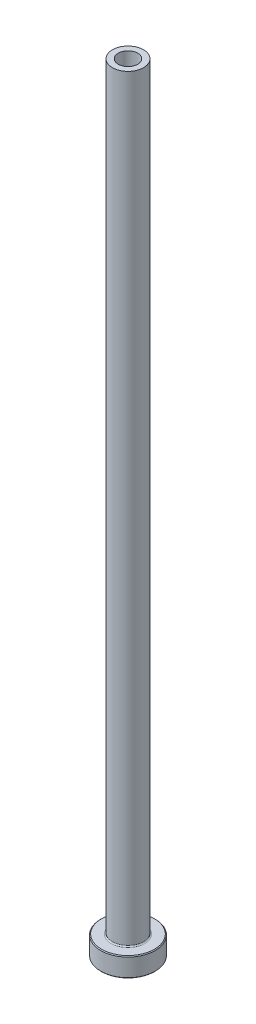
ISO-10303-21;
HEADER;
FILE_DESCRIPTION(('STEP AP214'),'2;1');
FILE_NAME('part.step','',(''),(''),'','','');
FILE_SCHEMA(('AUTOMOTIVE_DESIGN { 1 0 10303 214 1 1 1 1 }'));
ENDSEC;
DATA;
#1=APPLICATION_CONTEXT('core data for automotive mechanical design processes');
#2=APPLICATION_PROTOCOL_DEFINITION('international standard','automotive_design',2000,#1);
#3=PRODUCT_CONTEXT('',#1,'mechanical');
#4=PRODUCT('Part','Part','',(#3));
#5=PRODUCT_RELATED_PRODUCT_CATEGORY('part','',(#4));
#6=PRODUCT_DEFINITION_FORMATION('','',#4);
#7=PRODUCT_DEFINITION_CONTEXT('part definition',#1,'design');
#8=PRODUCT_DEFINITION('design','',#6,#7);
#9=PRODUCT_DEFINITION_SHAPE('','',#8);
#10=(LENGTH_UNIT() NAMED_UNIT(*) SI_UNIT(.MILLI.,.METRE.));
#11=(NAMED_UNIT(*) PLANE_ANGLE_UNIT() SI_UNIT($,.RADIAN.));
#12=(NAMED_UNIT(*) SI_UNIT($,.STERADIAN.) SOLID_ANGLE_UNIT());
#13=UNCERTAINTY_MEASURE_WITH_UNIT(LENGTH_MEASURE(1.E-05),#10,'distance_accuracy_value','');
#14=(GEOMETRIC_REPRESENTATION_CONTEXT(3) GLOBAL_UNCERTAINTY_ASSIGNED_CONTEXT((#13)) GLOBAL_UNIT_ASSIGNED_CONTEXT((#10,
#11,#12)) REPRESENTATION_CONTEXT('',''));
#15=CARTESIAN_POINT('',(0.,0.,0.));
#16=DIRECTION('',(0.,0.,1.));
#17=DIRECTION('',(1.,0.,0.));
#18=AXIS2_PLACEMENT_3D('',#15,#16,#17);
#19=CARTESIAN_POINT('',(0.,92.1876809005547,0.));
#20=DIRECTION('',(0.,1.,0.));
#21=DIRECTION('',(0.,0.,1.));
#22=AXIS2_PLACEMENT_3D('',#19,#20,#21);
#23=CYLINDRICAL_SURFACE('',#22,2.5);
#24=CARTESIAN_POINT('',(0.,200.,0.));
#25=DIRECTION('',(0.,1.,0.));
#26=DIRECTION('',(0.,0.,1.));
#27=AXIS2_PLACEMENT_3D('',#24,#25,#26);
#28=CIRCLE('',#27,2.5);
#29=CARTESIAN_POINT('',(0.,200.,2.5));
#30=VERTEX_POINT('',#29);
#31=EDGE_CURVE('E62',#30,#30,#28,.T.);
#32=ORIENTED_EDGE('',*,*,#31,.T.);
#33=EDGE_LOOP('',(#32));
#34=FACE_BOUND('',#33,.T.);
#35=CARTESIAN_POINT('',(0.,155.,0.));
#36=DIRECTION('',(0.,1.,0.));
#37=DIRECTION('',(0.,0.,1.));
#38=AXIS2_PLACEMENT_3D('',#35,#36,#37);
#39=CIRCLE('',#38,2.50000000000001);
#40=CARTESIAN_POINT('',(0.,155.,2.50000000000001));
#41=VERTEX_POINT('',#40);
#42=EDGE_CURVE('E71',#41,#41,#39,.T.);
#43=ORIENTED_EDGE('',*,*,#42,.F.);
#44=EDGE_LOOP('',(#43));
#45=FACE_BOUND('',#44,.T.);
#46=ADVANCED_FACE('F30',(#34,#45),#23,.F.);
#47=CARTESIAN_POINT('',(-2.5,200.,0.));
#48=DIRECTION('',(0.,1.,0.));
#49=DIRECTION('',(0.,0.,1.));
#50=AXIS2_PLACEMENT_3D('',#47,#48,#49);
#51=PLANE('',#50);
#52=CARTESIAN_POINT('',(0.,200.,0.));
#53=DIRECTION('',(0.,1.,0.));
#54=DIRECTION('',(0.,0.,1.));
#55=AXIS2_PLACEMENT_3D('',#52,#53,#54);
#56=CIRCLE('',#55,4.00000000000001);
#57=CARTESIAN_POINT('',(0.,200.,4.00000000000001));
#58=VERTEX_POINT('',#57);
#59=EDGE_CURVE('E65',#58,#58,#56,.T.);
#60=ORIENTED_EDGE('',*,*,#59,.T.);
#61=EDGE_LOOP('',(#60));
#62=FACE_BOUND('',#61,.T.);
#63=ORIENTED_EDGE('',*,*,#31,.F.);
#64=EDGE_LOOP('',(#63));
#65=FACE_BOUND('',#64,.T.);
#66=ADVANCED_FACE('F79',(#62,#65),#51,.T.);
#67=CARTESIAN_POINT('',(0.,92.1876809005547,0.));
#68=DIRECTION('',(0.,1.,0.));
#69=DIRECTION('',(0.,0.,1.));
#70=AXIS2_PLACEMENT_3D('',#67,#68,#69);
#71=CYLINDRICAL_SURFACE('',#70,4.);
#72=CARTESIAN_POINT('',(0.,5.3,0.));
#73=DIRECTION('',(0.,1.,0.));
#74=DIRECTION('',(0.,0.,1.));
#75=AXIS2_PLACEMENT_3D('',#72,#73,#74);
#76=CIRCLE('',#75,4.);
#77=CARTESIAN_POINT('',(0.,5.3,4.));
#78=VERTEX_POINT('',#77);
#79=EDGE_CURVE('E59',#78,#78,#76,.T.);
#80=ORIENTED_EDGE('',*,*,#79,.T.);
#81=EDGE_LOOP('',(#80));
#82=FACE_BOUND('',#81,.T.);
#83=ORIENTED_EDGE('',*,*,#59,.F.);
#84=EDGE_LOOP('',(#83));
#85=FACE_BOUND('',#84,.T.);
#86=ADVANCED_FACE('F85',(#82,#85),#71,.T.);
#87=CARTESIAN_POINT('',(-3.99999999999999,5.,0.));
#88=DIRECTION('',(0.,1.,0.));
#89=DIRECTION('',(0.,0.,1.));
#90=AXIS2_PLACEMENT_3D('',#87,#88,#89);
#91=PLANE('',#90);
#92=CARTESIAN_POINT('',(0.,5.,0.));
#93=DIRECTION('',(0.,1.,0.));
#94=DIRECTION('',(0.,0.,1.));
#95=AXIS2_PLACEMENT_3D('',#92,#93,#94);
#96=CIRCLE('',#95,6.8);
#97=CARTESIAN_POINT('',(0.,5.,6.8));
#98=VERTEX_POINT('',#97);
#99=EDGE_CURVE('E53',#98,#98,#96,.T.);
#100=ORIENTED_EDGE('',*,*,#99,.T.);
#101=EDGE_LOOP('',(#100));
#102=FACE_BOUND('',#101,.T.);
#103=CARTESIAN_POINT('',(0.,5.,0.));
#104=DIRECTION('',(0.,1.,0.));
#105=DIRECTION('',(0.,0.,1.));
#106=AXIS2_PLACEMENT_3D('',#103,#104,#105);
#107=CIRCLE('',#106,4.3);
#108=CARTESIAN_POINT('',(0.,5.,4.3));
#109=VERTEX_POINT('',#108);
#110=EDGE_CURVE('E56',#109,#109,#107,.F.);
#111=ORIENTED_EDGE('',*,*,#110,.T.);
#112=EDGE_LOOP('',(#111));
#113=FACE_BOUND('',#112,.T.);
#114=ADVANCED_FACE('F111',(#102,#113),#91,.T.);
#115=CARTESIAN_POINT('',(0.,92.1876809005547,0.));
#116=DIRECTION('',(0.,1.,0.));
#117=DIRECTION('',(0.,0.,1.));
#118=AXIS2_PLACEMENT_3D('',#115,#116,#117);
#119=CYLINDRICAL_SURFACE('',#118,6.99999999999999);
#120=CARTESIAN_POINT('',(0.,4.8,0.));
#121=DIRECTION('',(0.,1.,0.));
#122=DIRECTION('',(0.,0.,1.));
#123=AXIS2_PLACEMENT_3D('',#120,#121,#122);
#124=CIRCLE('',#123,6.99999999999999);
#125=CARTESIAN_POINT('',(0.,4.8,6.99999999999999));
#126=VERTEX_POINT('',#125);
#127=EDGE_CURVE('E45',#126,#126,#124,.F.);
#128=ORIENTED_EDGE('',*,*,#127,.T.);
#129=EDGE_LOOP('',(#128));
#130=FACE_BOUND('',#129,.T.);
#131=CARTESIAN_POINT('',(0.,0.20000000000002,0.));
#132=DIRECTION('',(0.,-1.,0.));
#133=DIRECTION('',(0.,0.,-1.));
#134=AXIS2_PLACEMENT_3D('',#131,#132,#133);
#135=CIRCLE('',#134,6.99999999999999);
#136=CARTESIAN_POINT('',(0.,0.20000000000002,-6.99999999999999));
#137=VERTEX_POINT('',#136);
#138=EDGE_CURVE('E50',#137,#137,#135,.F.);
#139=ORIENTED_EDGE('',*,*,#138,.T.);
#140=EDGE_LOOP('',(#139));
#141=FACE_BOUND('',#140,.T.);
#142=ADVANCED_FACE('F108',(#130,#141),#119,.T.);
#143=CARTESIAN_POINT('',(-6.99999999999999,0.,0.));
#144=DIRECTION('',(0.,-1.,0.));
#145=DIRECTION('',(0.,0.,-1.));
#146=AXIS2_PLACEMENT_3D('',#143,#144,#145);
#147=PLANE('',#146);
#148=CARTESIAN_POINT('',(0.,0.,0.));
#149=DIRECTION('',(0.,-1.,0.));
#150=DIRECTION('',(0.,0.,-1.));
#151=AXIS2_PLACEMENT_3D('',#148,#149,#150);
#152=CIRCLE('',#151,3.24999999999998);
#153=CARTESIAN_POINT('',(0.,0.,-3.24999999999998));
#154=VERTEX_POINT('',#153);
#155=EDGE_CURVE('E37',#154,#154,#152,.F.);
#156=ORIENTED_EDGE('',*,*,#155,.T.);
#157=EDGE_LOOP('',(#156));
#158=FACE_BOUND('',#157,.T.);
#159=CARTESIAN_POINT('',(0.,0.,0.));
#160=DIRECTION('',(0.,-1.,0.));
#161=DIRECTION('',(0.,0.,-1.));
#162=AXIS2_PLACEMENT_3D('',#159,#160,#161);
#163=CIRCLE('',#162,6.79999999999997);
#164=CARTESIAN_POINT('',(0.,0.,-6.79999999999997));
#165=VERTEX_POINT('',#164);
#166=EDGE_CURVE('E41',#165,#165,#163,.T.);
#167=ORIENTED_EDGE('',*,*,#166,.T.);
#168=EDGE_LOOP('',(#167));
#169=FACE_BOUND('',#168,.T.);
#170=ADVANCED_FACE('F110',(#158,#169),#147,.T.);
#171=CARTESIAN_POINT('',(0.,92.1876809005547,0.));
#172=DIRECTION('',(0.,1.,0.));
#173=DIRECTION('',(0.,0.,1.));
#174=AXIS2_PLACEMENT_3D('',#171,#172,#173);
#175=CYLINDRICAL_SURFACE('',#174,2.75);
#176=CARTESIAN_POINT('',(0.,0.5,0.));
#177=DIRECTION('',(0.,-1.,0.));
#178=DIRECTION('',(0.,0.,-1.));
#179=AXIS2_PLACEMENT_3D('',#176,#177,#178);
#180=CIRCLE('',#179,2.75);
#181=CARTESIAN_POINT('',(0.,0.5,-2.75));
#182=VERTEX_POINT('',#181);
#183=EDGE_CURVE('E10',#182,#182,#180,.T.);
#184=ORIENTED_EDGE('',*,*,#183,.T.);
#185=EDGE_LOOP('',(#184));
#186=FACE_BOUND('',#185,.T.);
#187=CARTESIAN_POINT('',(0.,143.,0.));
#188=DIRECTION('',(0.,1.,0.));
#189=DIRECTION('',(0.,0.,1.));
#190=AXIS2_PLACEMENT_3D('',#187,#188,#189);
#191=CIRCLE('',#190,2.75000000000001);
#192=CARTESIAN_POINT('',(0.,143.,2.75000000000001));
#193=VERTEX_POINT('',#192);
#194=EDGE_CURVE('E68',#193,#193,#191,.T.);
#195=ORIENTED_EDGE('',*,*,#194,.T.);
#196=EDGE_LOOP('',(#195));
#197=FACE_BOUND('',#196,.T.);
#198=ADVANCED_FACE('F118',(#186,#197),#175,.F.);
#199=CARTESIAN_POINT('',(0.,143.,0.));
#200=DIRECTION('',(0.,-1.,0.));
#201=DIRECTION('',(0.,0.,-1.));
#202=AXIS2_PLACEMENT_3D('',#199,#200,#201);
#203=CONICAL_SURFACE('',#202,2.75000000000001,0.0208303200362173);
#204=ORIENTED_EDGE('',*,*,#42,.T.);
#205=EDGE_LOOP('',(#204));
#206=FACE_BOUND('',#205,.T.);
#207=ORIENTED_EDGE('',*,*,#194,.F.);
#208=EDGE_LOOP('',(#207));
#209=FACE_BOUND('',#208,.T.);
#210=ADVANCED_FACE('F75',(#206,#209),#203,.F.);
#211=CARTESIAN_POINT('',(0.,5.3,0.));
#212=DIRECTION('',(0.,1.,0.));
#213=DIRECTION('',(0.,0.,1.));
#214=AXIS2_PLACEMENT_3D('',#211,#212,#213);
#215=TOROIDAL_SURFACE('',#214,4.3,0.3);
#216=ORIENTED_EDGE('',*,*,#110,.F.);
#217=EDGE_LOOP('',(#216));
#218=FACE_BOUND('',#217,.T.);
#219=ORIENTED_EDGE('',*,*,#79,.F.);
#220=EDGE_LOOP('',(#219));
#221=FACE_BOUND('',#220,.T.);
#222=ADVANCED_FACE('F90',(#218,#221),#215,.F.);
#223=CARTESIAN_POINT('',(0.,5.,0.));
#224=DIRECTION('',(0.,-1.,0.));
#225=DIRECTION('',(0.,0.,-1.));
#226=AXIS2_PLACEMENT_3D('',#223,#224,#225);
#227=CONICAL_SURFACE('',#226,6.8,0.785398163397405);
#228=ORIENTED_EDGE('',*,*,#127,.F.);
#229=EDGE_LOOP('',(#228));
#230=FACE_BOUND('',#229,.T.);
#231=ORIENTED_EDGE('',*,*,#99,.F.);
#232=EDGE_LOOP('',(#231));
#233=FACE_BOUND('',#232,.T.);
#234=ADVANCED_FACE('F93',(#230,#233),#227,.T.);
#235=CARTESIAN_POINT('',(0.,0.20000000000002,0.));
#236=DIRECTION('',(0.,1.,0.));
#237=DIRECTION('',(0.,0.,1.));
#238=AXIS2_PLACEMENT_3D('',#235,#236,#237);
#239=CONICAL_SURFACE('',#238,6.99999999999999,0.78539816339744);
#240=ORIENTED_EDGE('',*,*,#166,.F.);
#241=EDGE_LOOP('',(#240));
#242=FACE_BOUND('',#241,.T.);
#243=ORIENTED_EDGE('',*,*,#138,.F.);
#244=EDGE_LOOP('',(#243));
#245=FACE_BOUND('',#244,.T.);
#246=ADVANCED_FACE('F96',(#242,#245),#239,.T.);
#247=CARTESIAN_POINT('',(0.,0.,0.));
#248=DIRECTION('',(0.,-1.,0.));
#249=DIRECTION('',(0.,0.,-1.));
#250=AXIS2_PLACEMENT_3D('',#247,#248,#249);
#251=CONICAL_SURFACE('',#250,3.24999999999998,0.785398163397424);
#252=ORIENTED_EDGE('',*,*,#183,.F.);
#253=EDGE_LOOP('',(#252));
#254=FACE_BOUND('',#253,.T.);
#255=ORIENTED_EDGE('',*,*,#155,.F.);
#256=EDGE_LOOP('',(#255));
#257=FACE_BOUND('',#256,.T.);
#258=ADVANCED_FACE('F32',(#254,#257),#251,.F.);
#259=CLOSED_SHELL('',(#46,#66,#86,#114,#142,#170,#198,#210,#222,#234,#246,#258));
#260=MANIFOLD_SOLID_BREP('B2',#259);
#261=ADVANCED_BREP_SHAPE_REPRESENTATION('',(#18,#260),#14);
#262=SHAPE_DEFINITION_REPRESENTATION(#9,#261);
ENDSEC;
END-ISO-10303-21;
